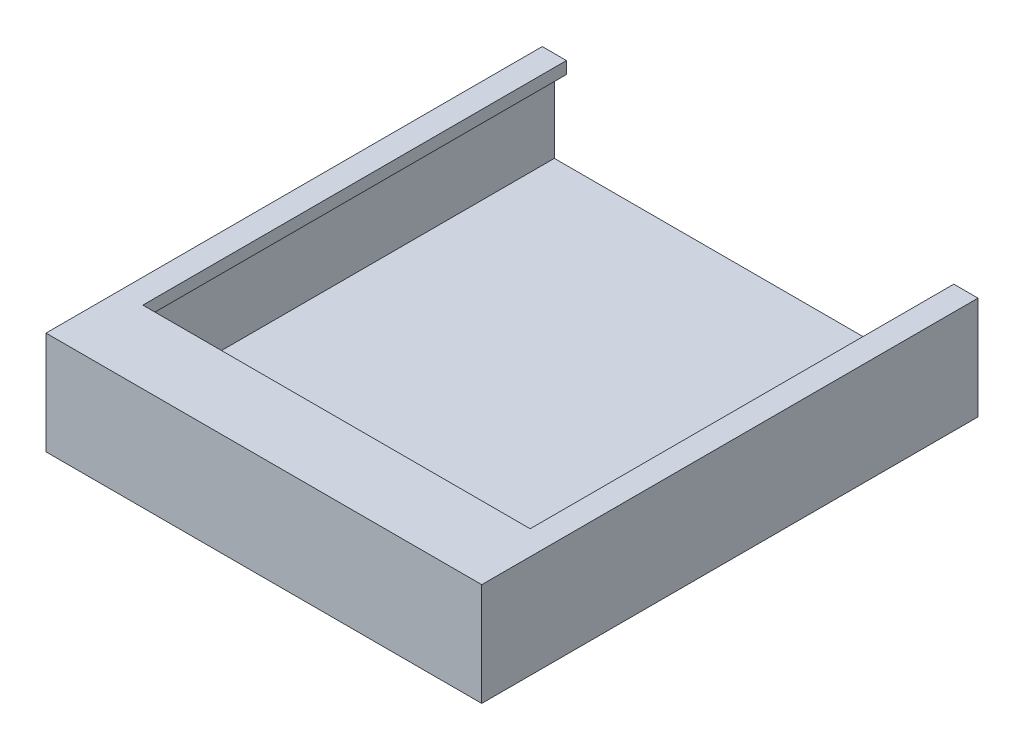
ISO-10303-21;
HEADER;
FILE_DESCRIPTION(('STEP AP214'),'2;1');
FILE_NAME('part.step','',(''),(''),'','','');
FILE_SCHEMA(('AUTOMOTIVE_DESIGN { 1 0 10303 214 1 1 1 1 }'));
ENDSEC;
DATA;
#1=APPLICATION_CONTEXT('core data for automotive mechanical design processes');
#2=APPLICATION_PROTOCOL_DEFINITION('international standard','automotive_design',2000,#1);
#3=PRODUCT_CONTEXT('',#1,'mechanical');
#4=PRODUCT('Part','Part','',(#3));
#5=PRODUCT_RELATED_PRODUCT_CATEGORY('part','',(#4));
#6=PRODUCT_DEFINITION_FORMATION('','',#4);
#7=PRODUCT_DEFINITION_CONTEXT('part definition',#1,'design');
#8=PRODUCT_DEFINITION('design','',#6,#7);
#9=PRODUCT_DEFINITION_SHAPE('','',#8);
#10=(LENGTH_UNIT() NAMED_UNIT(*) SI_UNIT(.MILLI.,.METRE.));
#11=(NAMED_UNIT(*) PLANE_ANGLE_UNIT() SI_UNIT($,.RADIAN.));
#12=(NAMED_UNIT(*) SI_UNIT($,.STERADIAN.) SOLID_ANGLE_UNIT());
#13=UNCERTAINTY_MEASURE_WITH_UNIT(LENGTH_MEASURE(1.E-05),#10,'distance_accuracy_value','');
#14=(GEOMETRIC_REPRESENTATION_CONTEXT(3) GLOBAL_UNCERTAINTY_ASSIGNED_CONTEXT((#13)) GLOBAL_UNIT_ASSIGNED_CONTEXT((#10,
#11,#12)) REPRESENTATION_CONTEXT('',''));
#15=CARTESIAN_POINT('',(0.,0.,0.));
#16=DIRECTION('',(0.,0.,1.));
#17=DIRECTION('',(1.,0.,0.));
#18=AXIS2_PLACEMENT_3D('',#15,#16,#17);
#19=CARTESIAN_POINT('',(-34.,17.,-40.));
#20=DIRECTION('',(-1.,0.,0.));
#21=DIRECTION('',(0.,0.,1.));
#22=AXIS2_PLACEMENT_3D('',#19,#20,#21);
#23=PLANE('',#22);
#24=DIRECTION('',(0.,-1.,0.));
#25=VECTOR('',#24,1.);
#26=CARTESIAN_POINT('',(-34.,17.,-40.));
#27=LINE('',#26,#25);
#28=CARTESIAN_POINT('',(-34.,15.,-40.));
#29=VERTEX_POINT('',#28);
#30=CARTESIAN_POINT('',(-34.,2.,-40.));
#31=VERTEX_POINT('',#30);
#32=EDGE_CURVE('E37',#29,#31,#27,.T.);
#33=ORIENTED_EDGE('',*,*,#32,.F.);
#34=DIRECTION('',(0.,0.,1.));
#35=VECTOR('',#34,1.);
#36=CARTESIAN_POINT('',(-34.,15.,30.));
#37=LINE('',#36,#35);
#38=CARTESIAN_POINT('',(-34.,15.,40.));
#39=VERTEX_POINT('',#38);
#40=EDGE_CURVE('E149',#29,#39,#37,.T.);
#41=ORIENTED_EDGE('',*,*,#40,.T.);
#42=DIRECTION('',(0.,-1.,0.));
#43=VECTOR('',#42,1.);
#44=CARTESIAN_POINT('',(-34.,17.,40.));
#45=LINE('',#44,#43);
#46=CARTESIAN_POINT('',(-34.,2.,40.));
#47=VERTEX_POINT('',#46);
#48=EDGE_CURVE('E176',#39,#47,#45,.T.);
#49=ORIENTED_EDGE('',*,*,#48,.T.);
#50=DIRECTION('',(0.,0.,1.));
#51=VECTOR('',#50,1.);
#52=CARTESIAN_POINT('',(-34.,2.,-40.));
#53=LINE('',#52,#51);
#54=EDGE_CURVE('E43',#31,#47,#53,.T.);
#55=ORIENTED_EDGE('',*,*,#54,.F.);
#56=EDGE_LOOP('',(#33,#41,#49,#55));
#57=FACE_BOUND('',#56,.T.);
#58=ADVANCED_FACE('F33',(#57),#23,.F.);
#59=CARTESIAN_POINT('',(0.,0.,30.));
#60=DIRECTION('',(0.,0.,-1.));
#61=DIRECTION('',(-1.,0.,0.));
#62=AXIS2_PLACEMENT_3D('',#59,#60,#61);
#63=PLANE('',#62);
#64=DIRECTION('',(-1.,0.,0.));
#65=VECTOR('',#64,1.);
#66=CARTESIAN_POINT('',(34.,15.,30.));
#67=LINE('',#66,#65);
#68=CARTESIAN_POINT('',(32.,15.,30.));
#69=VERTEX_POINT('',#68);
#70=CARTESIAN_POINT('',(-32.,15.,30.));
#71=VERTEX_POINT('',#70);
#72=EDGE_CURVE('E131',#69,#71,#67,.T.);
#73=ORIENTED_EDGE('',*,*,#72,.T.);
#74=DIRECTION('',(0.,-1.,0.));
#75=VECTOR('',#74,1.);
#76=CARTESIAN_POINT('',(-32.,15.,30.));
#77=LINE('',#76,#75);
#78=CARTESIAN_POINT('',(-32.,17.,30.));
#79=VERTEX_POINT('',#78);
#80=EDGE_CURVE('E137',#79,#71,#77,.T.);
#81=ORIENTED_EDGE('',*,*,#80,.F.);
#82=DIRECTION('',(1.,0.,0.));
#83=VECTOR('',#82,1.);
#84=CARTESIAN_POINT('',(34.,17.,30.));
#85=LINE('',#84,#83);
#86=CARTESIAN_POINT('',(32.,17.,30.));
#87=VERTEX_POINT('',#86);
#88=EDGE_CURVE('E146',#79,#87,#85,.T.);
#89=ORIENTED_EDGE('',*,*,#88,.T.);
#90=DIRECTION('',(0.,1.,0.));
#91=VECTOR('',#90,1.);
#92=CARTESIAN_POINT('',(32.,15.,30.));
#93=LINE('',#92,#91);
#94=EDGE_CURVE('E145',#69,#87,#93,.T.);
#95=ORIENTED_EDGE('',*,*,#94,.F.);
#96=EDGE_LOOP('',(#73,#81,#89,#95));
#97=FACE_BOUND('',#96,.T.);
#98=ADVANCED_FACE('F143',(#97),#63,.T.);
#99=CARTESIAN_POINT('',(34.,17.,-40.));
#100=DIRECTION('',(1.,0.,0.));
#101=DIRECTION('',(0.,0.,-1.));
#102=AXIS2_PLACEMENT_3D('',#99,#100,#101);
#103=PLANE('',#102);
#104=DIRECTION('',(0.,0.,1.));
#105=VECTOR('',#104,1.);
#106=CARTESIAN_POINT('',(34.,15.,30.));
#107=LINE('',#106,#105);
#108=CARTESIAN_POINT('',(34.,15.,-40.));
#109=VERTEX_POINT('',#108);
#110=CARTESIAN_POINT('',(34.,15.,40.));
#111=VERTEX_POINT('',#110);
#112=EDGE_CURVE('E59',#109,#111,#107,.T.);
#113=ORIENTED_EDGE('',*,*,#112,.F.);
#114=DIRECTION('',(0.,-1.,0.));
#115=VECTOR('',#114,1.);
#116=CARTESIAN_POINT('',(34.,17.,-40.));
#117=LINE('',#116,#115);
#118=CARTESIAN_POINT('',(34.,2.,-40.));
#119=VERTEX_POINT('',#118);
#120=EDGE_CURVE('E186',#109,#119,#117,.T.);
#121=ORIENTED_EDGE('',*,*,#120,.T.);
#122=DIRECTION('',(0.,0.,-1.));
#123=VECTOR('',#122,1.);
#124=CARTESIAN_POINT('',(34.,2.,-40.));
#125=LINE('',#124,#123);
#126=CARTESIAN_POINT('',(34.,2.,40.));
#127=VERTEX_POINT('',#126);
#128=EDGE_CURVE('E203',#127,#119,#125,.T.);
#129=ORIENTED_EDGE('',*,*,#128,.F.);
#130=DIRECTION('',(0.,-1.,0.));
#131=VECTOR('',#130,1.);
#132=CARTESIAN_POINT('',(34.,17.,40.));
#133=LINE('',#132,#131);
#134=EDGE_CURVE('E183',#111,#127,#133,.T.);
#135=ORIENTED_EDGE('',*,*,#134,.F.);
#136=EDGE_LOOP('',(#113,#121,#129,#135));
#137=FACE_BOUND('',#136,.T.);
#138=ADVANCED_FACE('F226',(#137),#103,.F.);
#139=CARTESIAN_POINT('',(-36.,17.,40.));
#140=DIRECTION('',(0.,0.,1.));
#141=DIRECTION('',(1.,0.,0.));
#142=AXIS2_PLACEMENT_3D('',#139,#140,#141);
#143=PLANE('',#142);
#144=DIRECTION('',(-1.,0.,0.));
#145=VECTOR('',#144,1.);
#146=CARTESIAN_POINT('',(34.,15.,40.));
#147=LINE('',#146,#145);
#148=EDGE_CURVE('E147',#111,#39,#147,.T.);
#149=ORIENTED_EDGE('',*,*,#148,.F.);
#150=ORIENTED_EDGE('',*,*,#134,.T.);
#151=DIRECTION('',(1.,0.,0.));
#152=VECTOR('',#151,1.);
#153=CARTESIAN_POINT('',(-34.,2.,40.));
#154=LINE('',#153,#152);
#155=EDGE_CURVE('E11',#47,#127,#154,.T.);
#156=ORIENTED_EDGE('',*,*,#155,.F.);
#157=ORIENTED_EDGE('',*,*,#48,.F.);
#158=EDGE_LOOP('',(#149,#150,#156,#157));
#159=FACE_BOUND('',#158,.T.);
#160=ADVANCED_FACE('F224',(#159),#143,.F.);
#161=CARTESIAN_POINT('',(-34.,2.,-40.));
#162=DIRECTION('',(0.,0.,1.));
#163=DIRECTION('',(1.,0.,0.));
#164=AXIS2_PLACEMENT_3D('',#161,#162,#163);
#165=PLANE('',#164);
#166=DIRECTION('',(-1.,0.,0.));
#167=VECTOR('',#166,1.);
#168=CARTESIAN_POINT('',(-34.,0.,-40.));
#169=LINE('',#168,#167);
#170=CARTESIAN_POINT('',(36.,0.,-40.));
#171=VERTEX_POINT('',#170);
#172=CARTESIAN_POINT('',(-36.,0.,-40.));
#173=VERTEX_POINT('',#172);
#174=EDGE_CURVE('E207',#171,#173,#169,.T.);
#175=ORIENTED_EDGE('',*,*,#174,.T.);
#176=DIRECTION('',(0.,-1.,0.));
#177=VECTOR('',#176,1.);
#178=CARTESIAN_POINT('',(-36.,17.,-40.));
#179=LINE('',#178,#177);
#180=CARTESIAN_POINT('',(-36.,17.,-40.));
#181=VERTEX_POINT('',#180);
#182=EDGE_CURVE('E180',#181,#173,#179,.T.);
#183=ORIENTED_EDGE('',*,*,#182,.F.);
#184=DIRECTION('',(-1.,0.,0.));
#185=VECTOR('',#184,1.);
#186=CARTESIAN_POINT('',(-34.,17.,-40.));
#187=LINE('',#186,#185);
#188=CARTESIAN_POINT('',(-32.,17.,-40.));
#189=VERTEX_POINT('',#188);
#190=EDGE_CURVE('E172',#189,#181,#187,.T.);
#191=ORIENTED_EDGE('',*,*,#190,.F.);
#192=DIRECTION('',(0.,1.,0.));
#193=VECTOR('',#192,1.);
#194=CARTESIAN_POINT('',(-32.,15.,-40.));
#195=LINE('',#194,#193);
#196=CARTESIAN_POINT('',(-32.,15.,-40.));
#197=VERTEX_POINT('',#196);
#198=EDGE_CURVE('E136',#197,#189,#195,.T.);
#199=ORIENTED_EDGE('',*,*,#198,.F.);
#200=DIRECTION('',(-1.,0.,0.));
#201=VECTOR('',#200,1.);
#202=CARTESIAN_POINT('',(-32.,15.,-40.));
#203=LINE('',#202,#201);
#204=EDGE_CURVE('E134',#197,#29,#203,.T.);
#205=ORIENTED_EDGE('',*,*,#204,.T.);
#206=ORIENTED_EDGE('',*,*,#32,.T.);
#207=DIRECTION('',(-1.,0.,0.));
#208=VECTOR('',#207,1.);
#209=CARTESIAN_POINT('',(-34.,2.,-40.));
#210=LINE('',#209,#208);
#211=EDGE_CURVE('E206',#119,#31,#210,.T.);
#212=ORIENTED_EDGE('',*,*,#211,.F.);
#213=ORIENTED_EDGE('',*,*,#120,.F.);
#214=DIRECTION('',(1.,0.,0.));
#215=VECTOR('',#214,1.);
#216=CARTESIAN_POINT('',(32.,15.,-40.));
#217=LINE('',#216,#215);
#218=CARTESIAN_POINT('',(32.,15.,-40.));
#219=VERTEX_POINT('',#218);
#220=EDGE_CURVE('E151',#219,#109,#217,.T.);
#221=ORIENTED_EDGE('',*,*,#220,.F.);
#222=DIRECTION('',(0.,-1.,0.));
#223=VECTOR('',#222,1.);
#224=CARTESIAN_POINT('',(32.,15.,-40.));
#225=LINE('',#224,#223);
#226=CARTESIAN_POINT('',(32.,17.,-40.));
#227=VERTEX_POINT('',#226);
#228=EDGE_CURVE('E288',#227,#219,#225,.T.);
#229=ORIENTED_EDGE('',*,*,#228,.F.);
#230=DIRECTION('',(-1.,0.,0.));
#231=VECTOR('',#230,1.);
#232=CARTESIAN_POINT('',(34.,17.,-40.));
#233=LINE('',#232,#231);
#234=CARTESIAN_POINT('',(36.,17.,-40.));
#235=VERTEX_POINT('',#234);
#236=EDGE_CURVE('E189',#235,#227,#233,.T.);
#237=ORIENTED_EDGE('',*,*,#236,.F.);
#238=DIRECTION('',(0.,-1.,0.));
#239=VECTOR('',#238,1.);
#240=CARTESIAN_POINT('',(36.,17.,-40.));
#241=LINE('',#240,#239);
#242=EDGE_CURVE('E188',#235,#171,#241,.T.);
#243=ORIENTED_EDGE('',*,*,#242,.T.);
#244=EDGE_LOOP('',(#175,#183,#191,#199,#205,#206,#212,#213,#221,#229,#237,#243));
#245=FACE_BOUND('',#244,.T.);
#246=ADVANCED_FACE('F35',(#245),#165,.F.);
#247=CARTESIAN_POINT('',(0.,2.,0.));
#248=DIRECTION('',(0.,1.,0.));
#249=DIRECTION('',(0.,0.,1.));
#250=AXIS2_PLACEMENT_3D('',#247,#248,#249);
#251=PLANE('',#250);
#252=ORIENTED_EDGE('',*,*,#128,.T.);
#253=ORIENTED_EDGE('',*,*,#211,.T.);
#254=ORIENTED_EDGE('',*,*,#54,.T.);
#255=ORIENTED_EDGE('',*,*,#155,.T.);
#256=EDGE_LOOP('',(#252,#253,#254,#255));
#257=FACE_BOUND('',#256,.T.);
#258=ADVANCED_FACE('F227',(#257),#251,.T.);
#259=CARTESIAN_POINT('',(0.,0.,0.));
#260=DIRECTION('',(0.,1.,0.));
#261=DIRECTION('',(0.,0.,1.));
#262=AXIS2_PLACEMENT_3D('',#259,#260,#261);
#263=PLANE('',#262);
#264=ORIENTED_EDGE('',*,*,#174,.F.);
#265=DIRECTION('',(0.,0.,-1.));
#266=VECTOR('',#265,1.);
#267=CARTESIAN_POINT('',(36.,0.,-40.));
#268=LINE('',#267,#266);
#269=CARTESIAN_POINT('',(36.,0.,42.));
#270=VERTEX_POINT('',#269);
#271=EDGE_CURVE('E193',#270,#171,#268,.T.);
#272=ORIENTED_EDGE('',*,*,#271,.F.);
#273=DIRECTION('',(1.,0.,0.));
#274=VECTOR('',#273,1.);
#275=CARTESIAN_POINT('',(-36.,0.,42.));
#276=LINE('',#275,#274);
#277=CARTESIAN_POINT('',(-36.,0.,42.));
#278=VERTEX_POINT('',#277);
#279=EDGE_CURVE('E159',#278,#270,#276,.T.);
#280=ORIENTED_EDGE('',*,*,#279,.F.);
#281=DIRECTION('',(0.,0.,1.));
#282=VECTOR('',#281,1.);
#283=CARTESIAN_POINT('',(-36.,0.,-40.));
#284=LINE('',#283,#282);
#285=EDGE_CURVE('E171',#173,#278,#284,.T.);
#286=ORIENTED_EDGE('',*,*,#285,.F.);
#287=EDGE_LOOP('',(#264,#272,#280,#286));
#288=FACE_BOUND('',#287,.T.);
#289=ADVANCED_FACE('F229',(#288),#263,.F.);
#290=CARTESIAN_POINT('',(36.,17.,-40.));
#291=DIRECTION('',(-1.,0.,0.));
#292=DIRECTION('',(0.,0.,1.));
#293=AXIS2_PLACEMENT_3D('',#290,#291,#292);
#294=PLANE('',#293);
#295=ORIENTED_EDGE('',*,*,#271,.T.);
#296=ORIENTED_EDGE('',*,*,#242,.F.);
#297=DIRECTION('',(0.,0.,-1.));
#298=VECTOR('',#297,1.);
#299=CARTESIAN_POINT('',(36.,17.,-40.));
#300=LINE('',#299,#298);
#301=CARTESIAN_POINT('',(36.,17.,42.));
#302=VERTEX_POINT('',#301);
#303=EDGE_CURVE('E280',#302,#235,#300,.T.);
#304=ORIENTED_EDGE('',*,*,#303,.F.);
#305=DIRECTION('',(0.,-1.,0.));
#306=VECTOR('',#305,1.);
#307=CARTESIAN_POINT('',(36.,17.,42.));
#308=LINE('',#307,#306);
#309=EDGE_CURVE('E163',#302,#270,#308,.T.);
#310=ORIENTED_EDGE('',*,*,#309,.T.);
#311=EDGE_LOOP('',(#295,#296,#304,#310));
#312=FACE_BOUND('',#311,.T.);
#313=ADVANCED_FACE('F235',(#312),#294,.F.);
#314=CARTESIAN_POINT('',(0.,17.,0.));
#315=DIRECTION('',(0.,1.,0.));
#316=DIRECTION('',(0.,0.,1.));
#317=AXIS2_PLACEMENT_3D('',#314,#315,#316);
#318=PLANE('',#317);
#319=DIRECTION('',(0.,0.,1.));
#320=VECTOR('',#319,1.);
#321=CARTESIAN_POINT('',(-32.,17.,30.));
#322=LINE('',#321,#320);
#323=EDGE_CURVE('E51',#189,#79,#322,.T.);
#324=ORIENTED_EDGE('',*,*,#323,.F.);
#325=ORIENTED_EDGE('',*,*,#190,.T.);
#326=DIRECTION('',(0.,0.,1.));
#327=VECTOR('',#326,1.);
#328=CARTESIAN_POINT('',(-36.,17.,-40.));
#329=LINE('',#328,#327);
#330=CARTESIAN_POINT('',(-36.,17.,42.));
#331=VERTEX_POINT('',#330);
#332=EDGE_CURVE('E174',#181,#331,#329,.T.);
#333=ORIENTED_EDGE('',*,*,#332,.T.);
#334=DIRECTION('',(1.,0.,0.));
#335=VECTOR('',#334,1.);
#336=CARTESIAN_POINT('',(-36.,17.,42.));
#337=LINE('',#336,#335);
#338=EDGE_CURVE('E160',#331,#302,#337,.T.);
#339=ORIENTED_EDGE('',*,*,#338,.T.);
#340=ORIENTED_EDGE('',*,*,#303,.T.);
#341=ORIENTED_EDGE('',*,*,#236,.T.);
#342=DIRECTION('',(0.,0.,-1.));
#343=VECTOR('',#342,1.);
#344=CARTESIAN_POINT('',(32.,17.,30.));
#345=LINE('',#344,#343);
#346=EDGE_CURVE('E290',#87,#227,#345,.T.);
#347=ORIENTED_EDGE('',*,*,#346,.F.);
#348=ORIENTED_EDGE('',*,*,#88,.F.);
#349=EDGE_LOOP('',(#324,#325,#333,#339,#340,#341,#347,#348));
#350=FACE_BOUND('',#349,.T.);
#351=ADVANCED_FACE('F250',(#350),#318,.T.);
#352=CARTESIAN_POINT('',(-36.,17.,-40.));
#353=DIRECTION('',(1.,0.,0.));
#354=DIRECTION('',(0.,0.,-1.));
#355=AXIS2_PLACEMENT_3D('',#352,#353,#354);
#356=PLANE('',#355);
#357=ORIENTED_EDGE('',*,*,#285,.T.);
#358=DIRECTION('',(0.,-1.,0.));
#359=VECTOR('',#358,1.);
#360=CARTESIAN_POINT('',(-36.,17.,42.));
#361=LINE('',#360,#359);
#362=EDGE_CURVE('E168',#331,#278,#361,.T.);
#363=ORIENTED_EDGE('',*,*,#362,.F.);
#364=ORIENTED_EDGE('',*,*,#332,.F.);
#365=ORIENTED_EDGE('',*,*,#182,.T.);
#366=EDGE_LOOP('',(#357,#363,#364,#365));
#367=FACE_BOUND('',#366,.T.);
#368=ADVANCED_FACE('F248',(#367),#356,.F.);
#369=CARTESIAN_POINT('',(-36.,17.,42.));
#370=DIRECTION('',(0.,0.,-1.));
#371=DIRECTION('',(-1.,0.,0.));
#372=AXIS2_PLACEMENT_3D('',#369,#370,#371);
#373=PLANE('',#372);
#374=ORIENTED_EDGE('',*,*,#279,.T.);
#375=ORIENTED_EDGE('',*,*,#309,.F.);
#376=ORIENTED_EDGE('',*,*,#338,.F.);
#377=ORIENTED_EDGE('',*,*,#362,.T.);
#378=EDGE_LOOP('',(#374,#375,#376,#377));
#379=FACE_BOUND('',#378,.T.);
#380=ADVANCED_FACE('F264',(#379),#373,.F.);
#381=CARTESIAN_POINT('',(34.,15.,30.));
#382=DIRECTION('',(0.,1.,0.));
#383=DIRECTION('',(-1.,0.,0.));
#384=AXIS2_PLACEMENT_3D('',#381,#382,#383);
#385=PLANE('',#384);
#386=ORIENTED_EDGE('',*,*,#148,.T.);
#387=ORIENTED_EDGE('',*,*,#40,.F.);
#388=ORIENTED_EDGE('',*,*,#204,.F.);
#389=DIRECTION('',(0.,0.,-1.));
#390=VECTOR('',#389,1.);
#391=CARTESIAN_POINT('',(-32.,15.,30.));
#392=LINE('',#391,#390);
#393=EDGE_CURVE('E127',#71,#197,#392,.T.);
#394=ORIENTED_EDGE('',*,*,#393,.F.);
#395=ORIENTED_EDGE('',*,*,#72,.F.);
#396=DIRECTION('',(0.,0.,1.));
#397=VECTOR('',#396,1.);
#398=CARTESIAN_POINT('',(32.,15.,30.));
#399=LINE('',#398,#397);
#400=EDGE_CURVE('E286',#219,#69,#399,.T.);
#401=ORIENTED_EDGE('',*,*,#400,.F.);
#402=ORIENTED_EDGE('',*,*,#220,.T.);
#403=ORIENTED_EDGE('',*,*,#112,.T.);
#404=EDGE_LOOP('',(#386,#387,#388,#394,#395,#401,#402,#403));
#405=FACE_BOUND('',#404,.T.);
#406=ADVANCED_FACE('F128',(#405),#385,.F.);
#407=CARTESIAN_POINT('',(32.,0.,0.));
#408=DIRECTION('',(-1.,0.,0.));
#409=DIRECTION('',(0.,0.,1.));
#410=AXIS2_PLACEMENT_3D('',#407,#408,#409);
#411=PLANE('',#410);
#412=ORIENTED_EDGE('',*,*,#94,.T.);
#413=ORIENTED_EDGE('',*,*,#346,.T.);
#414=ORIENTED_EDGE('',*,*,#228,.T.);
#415=ORIENTED_EDGE('',*,*,#400,.T.);
#416=EDGE_LOOP('',(#412,#413,#414,#415));
#417=FACE_BOUND('',#416,.T.);
#418=ADVANCED_FACE('F271',(#417),#411,.T.);
#419=CARTESIAN_POINT('',(-32.,0.,0.));
#420=DIRECTION('',(-1.,0.,0.));
#421=DIRECTION('',(0.,0.,1.));
#422=AXIS2_PLACEMENT_3D('',#419,#420,#421);
#423=PLANE('',#422);
#424=ORIENTED_EDGE('',*,*,#80,.T.);
#425=ORIENTED_EDGE('',*,*,#393,.T.);
#426=ORIENTED_EDGE('',*,*,#198,.T.);
#427=ORIENTED_EDGE('',*,*,#323,.T.);
#428=EDGE_LOOP('',(#424,#425,#426,#427));
#429=FACE_BOUND('',#428,.T.);
#430=ADVANCED_FACE('F139',(#429),#423,.F.);
#431=CLOSED_SHELL('',(#58,#98,#138,#160,#246,#258,#289,#313,#351,#368,#380,#406,#418,#430));
#432=MANIFOLD_SOLID_BREP('B2',#431);
#433=ADVANCED_BREP_SHAPE_REPRESENTATION('',(#18,#432),#14);
#434=SHAPE_DEFINITION_REPRESENTATION(#9,#433);
ENDSEC;
END-ISO-10303-21;
